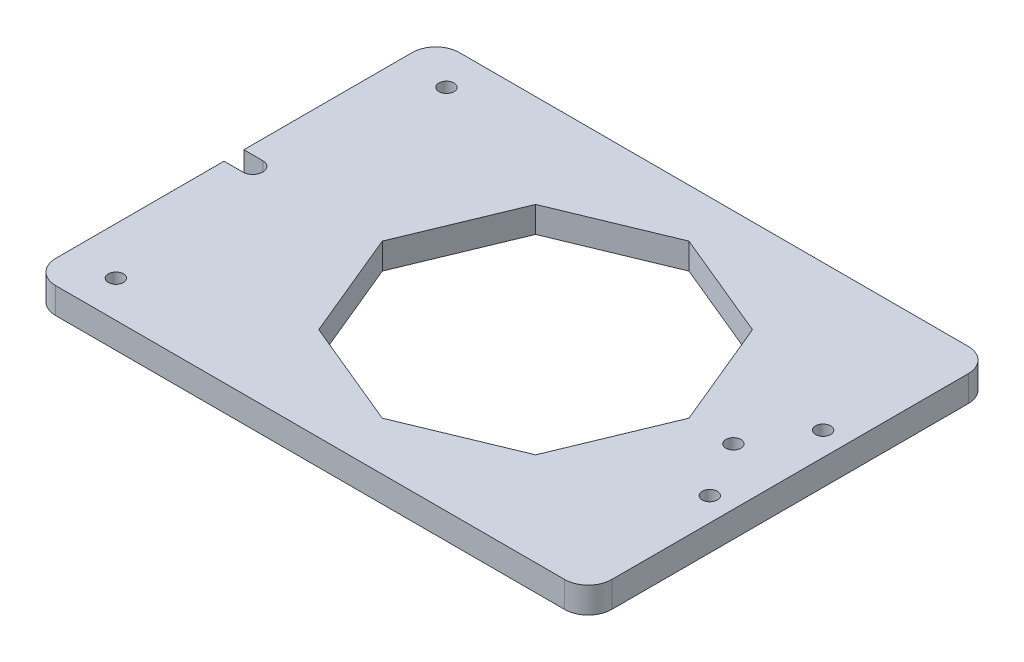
from build123d import *

# Parameters (mm, degrees)
SKETCH1_R           = 1.6
BOSS_EXTRUDE1_DEPTH = 5.5
FILLET1_R           = 5


with BuildPart() as part:
    # Sketch1 → Boss-Extrude1 (new body)
    with BuildSketch(Plane(origin=(0, 0, 0), x_dir=(1, 0, 0), z_dir=(0, 1, 0))):
        with BuildLine():
            Line((0, 42.74), (53.88, 42.74))
            Line((53.88, 42.74), (53.88, -42.74))
            Line((53.88, -42.74), (-63.88, -42.74))
            Line((-63.88, -42.74), (-63.88, -2.1))
            Line((-63.88, -2.1), (-59.88, -2.1))
            ThreePointArc((-59.88, -2.1), (-57.78, 0), (-59.88, 2.1))
            Line((-59.88, 2.1), (-63.88, 2.1))
            Line((-63.88, 2.1), (-63.88, 42.74))
            Line((-63.88, 42.74), (0, 42.74))
        make_face()
        with Locations(Location((48.88, 12, 0), (0, 0, 270))):
            Circle(SKETCH1_R, mode=Mode.SUBTRACT)
        with Locations(Location((48.88, -12, 0), (0, 0, 270))):
            Circle(SKETCH1_R, mode=Mode.SUBTRACT)
        with Locations(Location((41.88, 0, 0), (0, 0, 270))):
            Circle(SKETCH1_R, mode=Mode.SUBTRACT)
        with Locations(Location((-53.88, 35, 0), (0, 0, 270))):
            Circle(SKETCH1_R, mode=Mode.SUBTRACT)
        with Locations(Location((-53.88, -35, 0), (0, 0, 270))):
            Circle(SKETCH1_R, mode=Mode.SUBTRACT)
        Polygon((0, -32.471766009), (22.961005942, -22.961005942), (27.716385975, -11.480502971), (32.471766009, 0), (27.716385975, 11.480502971), (25.432771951, 16.993634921), (22.961005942, 22.961005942), (11.480502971, 27.716385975), (0, 32.471766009), (-11.480502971, 27.716385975), (-22.961005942, 22.961005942), (-27.716385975, 11.480502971), (-32.471766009, 0), (-27.716385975, -11.480502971), (-22.961005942, -22.961005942), (-11.480502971, -27.716385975), align=None, mode=Mode.SUBTRACT)
    extrude(amount=BOSS_EXTRUDE1_DEPTH)

    # Fillet1
    fillet1_edges = [part.edges().sort_by_distance(p)[0] for p in [
        (53.88, 2.75, 42.74),
        (-63.88, 2.75, 42.74),
        (-63.88, 2.75, -42.74),
        (53.88, 2.75, -42.74),
    ]]
    fillet(fillet1_edges, radius=FILLET1_R)


solid = part.part
